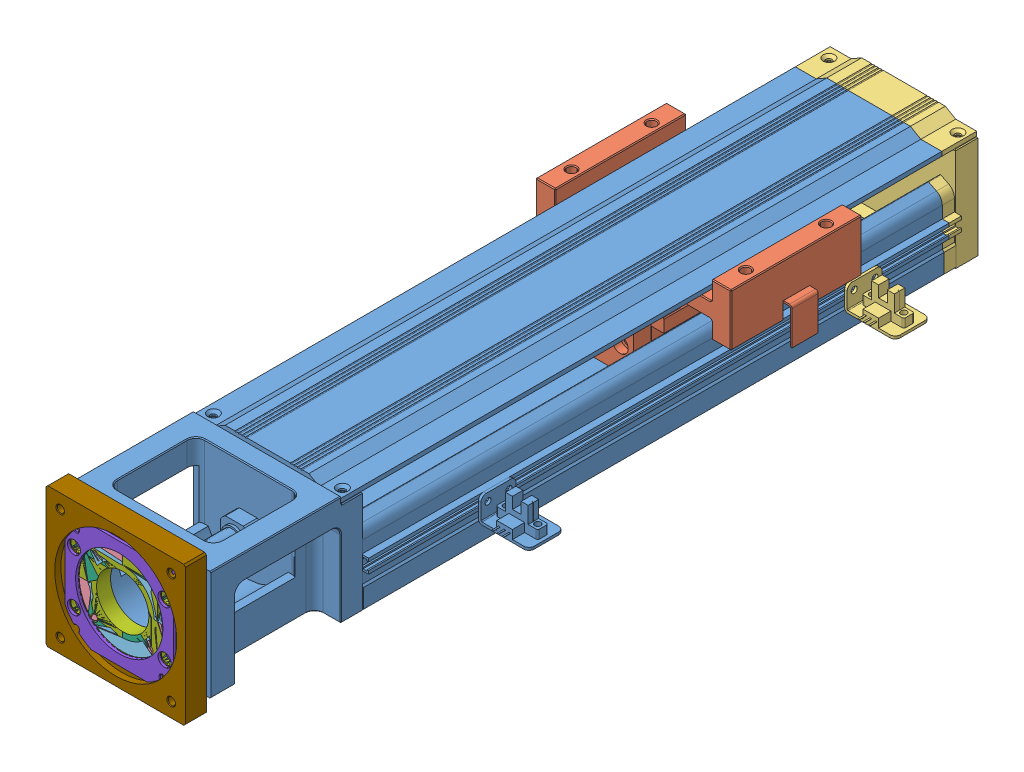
SolidWorks assembly FF86-B-0.SLDASM, configuration 340 (file format 9000). Lengths in mm.
Overall size (131 80 452).
9 component instances, 9 part files, 25 mates.
Components (placement in the parent):
- FF86-B-3-1: FF86-B-3.sldprt [340] at origin
- FF86-B-1-1: FF86-B-1.sldprt [默认] at (0 0 -162.375)
- FF86-B-2-1: FF86-B-2.sldprt [340] at (0 0 100)
- 电机法兰（57系列步进电机）-1: 电机法兰（57系列步进电机）.SLDPRT [默认] at (-27.9986 13.3299 220) x (1 0 0) z (0 -1 0)
- 电机法兰（60系列步进电机）-1: 电机法兰（60系列步进电机）.SLDPRT [默认] at (-27.9986 13.3299 220) x (1 0 0) z (0 -1 0)
- 电机法兰（三菱-安川）（30W-50W-100W）-1: 电机法兰（三菱-安川）（30W-50W-100W）.SLDPRT [默认] at (-27.9986 13.3299 220) x (1 0 0) z (0 -1 0)
- 电机法兰（松下30W-50W-100W）-1: 电机法兰（松下30W-50W-100W）.SLDPRT [默认] at (-27.9986 13.3299 220) x (1 0 0) z (0 -1 0)
- 电机法兰（松下200W-400W）-1: 电机法兰（松下200W-400W）.SLDPRT [默认] at (-27.9986 13.3299 220) x (1 0 0) z (0 -1 0)
- 电机法兰（松下750W）-1: 电机法兰（松下750W）.SLDPRT [默认] at (-27.9986 13.3299 220) x (1 0 0) z (0 -1 0)
Mates (geometry in assembly coordinates):
- 距离1: distance = 13.5 mm aligned: plane of FF86-B-1-1 through (28.0014 49.4099 -140.855) normal (1 0 0); plane of FF86-B-3-1 through (14.5014 46.0699 221.74) normal (1 0 0)
- 距离3: distance = 10 mm aligned: plane of FF86-B-3-1 through (-16.7674 -18.6701 -315.8) normal (0 -1 0); plane of FF86-B-1-1 through (-51.9186 -8.6701 -154.375) normal (0 -1 0)
- 重合3: coincident anti-aligned: plane of FF86-B-3-1 through (-63.9986 17.1217 -200) normal (0 0 -1); plane of FF86-B-2-1 through (-140.1135 640.6996 -200) normal (0 0 1)
- LimitDistance1: limit distance = 165.375 mm anti-aligned: plane of FF86-B-1-1 through (-4.5986 27.8899 -42.375) normal (0 0 1); plane of FF86-B-3-1 through (-5.1186 36.2099 123) normal (0 0 -1)
- LimitDistance2: limit distance = 54.625 mm anti-aligned: plane of FF86-B-1-1 through (3.2014 29.5799 -152.375) normal (0 0 -1); plane of FF86-B-2-1 through (-72.1986 -12.8221 -207) normal (0 0 1)
- 重合4: coincident aligned: plane of FF86-B-3-1 through (-70.9986 -17.2388 141.8) normal (-1 0 0); plane of FF86-B-2-1 through (-70.9986 -17.2388 241.8) normal (-1 0 0)
- 重合5: coincident anti-aligned: plane of FF86-B-3-1 through (16.2014 46.5899 220) normal (0 0 1); plane of 电机法兰（松下200W-400W）-1 through (-60.2386 -18.9101 220) normal (0 0 -1)
- 同心1: concentric aligned: cylinder of FF86-B-3-1 through (-53.9794 28.3299 210) axis (0 0 1) radius 1.6; cylinder of 电机法兰（松下200W-400W）-1 through (-53.9794 28.3299 220) axis (0 0 1) radius 2.25
- 同心2: concentric aligned: cylinder of FF86-B-3-1 through (-2.0179 -1.6701 210) axis (0 0 1) radius 1.6; cylinder of 电机法兰（松下200W-400W）-1 through (-2.0179 -1.6701 220) axis (0 0 1) radius 2.25
- 重合6: coincident anti-aligned: plane of FF86-B-3-1 through (16.2014 46.5899 220) normal (0 0 1); plane of 电机法兰（松下750W）-1 through (-69.5986 -28.2701 220) normal (0 0 -1)
- 同心3: concentric anti-aligned: circle of FF86-B-3-1; cylinder of 电机法兰（松下750W）-1 through (-53.9794 28.3299 220) axis (0 0 1) radius 2.25
- 同心4: concentric aligned: cylinder of FF86-B-3-1 through (-2.0179 28.3299 210) axis (0 0 1) radius 1.6; cylinder of 电机法兰（松下750W）-1 through (-2.0179 28.3299 220) axis (0 0 1) radius 2.25
- 重合7: coincident anti-aligned: plane of FF86-B-3-1 through (16.2014 46.5899 220) normal (0 0 1); plane of 电机法兰（松下30W-50W-100W）-1 through (-60.2386 -18.9101 220) normal (0 0 -1)
- 同心5: concentric aligned: cylinder of FF86-B-3-1 through (-53.9794 28.3299 210) axis (0 0 1) radius 1.6; cylinder of 电机法兰（松下30W-50W-100W）-1 through (-53.9794 28.3299 220) axis (0 0 1) radius 2.25
- 同心6: concentric aligned: cylinder of FF86-B-3-1 through (-2.0179 28.3299 210) axis (0 0 1) radius 1.6; cylinder of 电机法兰（松下30W-50W-100W）-1 through (-2.0179 28.3299 220) axis (0 0 1) radius 2.25
- 重合8: coincident anti-aligned: plane of FF86-B-3-1 through (16.2014 46.5899 220) normal (0 0 1); plane of 电机法兰（57系列步进电机）-1 through (-60.2386 -18.9101 220) normal (0 0 -1)
- 同心7: concentric aligned: cylinder of FF86-B-3-1 through (-53.9794 28.3299 210) axis (0 0 1) radius 1.6; cylinder of 电机法兰（57系列步进电机）-1 through (-53.9794 28.3299 223.5) axis (0 0 1) radius 3.75
- 同心8: concentric aligned: cylinder of FF86-B-3-1 through (-2.0179 28.3299 210) axis (0 0 1) radius 1.6; cylinder of 电机法兰（57系列步进电机）-1 through (-2.0179 28.3299 220) axis (0 0 1) radius 2.25
- 重合9: coincident anti-aligned: plane of FF86-B-3-1 through (16.2014 46.5899 220) normal (0 0 1); plane of 电机法兰（三菱-安川）（30W-50W-100W）-1 through (-60.2386 -18.9101 220) normal (0 0 -1)
- 同心9: concentric aligned: cylinder of FF86-B-3-1 through (-53.9794 28.3299 210) axis (0 0 1) radius 1.6; cylinder of 电机法兰（三菱-安川）（30W-50W-100W）-1 through (-53.9794 28.3299 220) axis (0 0 1) radius 2.25
- 同心10: concentric aligned: cylinder of FF86-B-3-1 through (-2.0179 28.3299 210) axis (0 0 1) radius 1.6; cylinder of 电机法兰（三菱-安川）（30W-50W-100W）-1 through (-2.0179 28.3299 220) axis (0 0 1) radius 2.25
- 重合10: coincident anti-aligned: plane of FF86-B-3-1 through (16.2014 46.5899 220) normal (0 0 1); plane of 电机法兰（60系列步进电机）-1 through (-60.2386 -18.9101 220) normal (0 0 -1)
- 同心11: concentric aligned: cylinder of FF86-B-3-1 through (-53.9794 28.3299 210) axis (0 0 1) radius 1.6; cylinder of 电机法兰（60系列步进电机）-1 through (-53.9794 28.3299 220) axis (0 0 1) radius 2.25
- 同心12: concentric aligned: cylinder of FF86-B-3-1 through (-2.0179 28.3299 210) axis (0 0 1) radius 1.6; cylinder of 电机法兰（60系列步进电机）-1 through (-2.0179 28.3299 220) axis (0 0 1) radius 2.25
- 重合11: coincident aligned: plane of FF86-B-3-1 through (-16.7674 -18.6701 -315.8) normal (0 -1 0); plane of FF86-B-2-1 through (-16.7674 -18.6701 -215.8) normal (0 -1 0)
